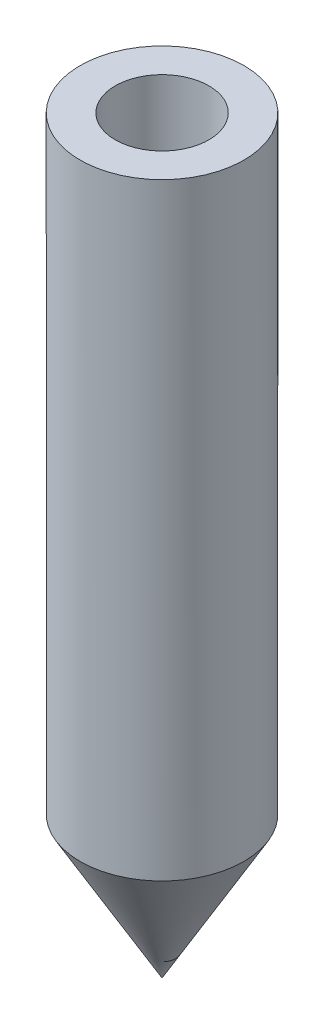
ISO-10303-21;
HEADER;
FILE_DESCRIPTION(('STEP AP214'),'2;1');
FILE_NAME('part.step','',(''),(''),'','','');
FILE_SCHEMA(('AUTOMOTIVE_DESIGN { 1 0 10303 214 1 1 1 1 }'));
ENDSEC;
DATA;
#1=APPLICATION_CONTEXT('core data for automotive mechanical design processes');
#2=APPLICATION_PROTOCOL_DEFINITION('international standard','automotive_design',2000,#1);
#3=PRODUCT_CONTEXT('',#1,'mechanical');
#4=PRODUCT('Part','Part','',(#3));
#5=PRODUCT_RELATED_PRODUCT_CATEGORY('part','',(#4));
#6=PRODUCT_DEFINITION_FORMATION('','',#4);
#7=PRODUCT_DEFINITION_CONTEXT('part definition',#1,'design');
#8=PRODUCT_DEFINITION('design','',#6,#7);
#9=PRODUCT_DEFINITION_SHAPE('','',#8);
#10=(LENGTH_UNIT() NAMED_UNIT(*) SI_UNIT(.MILLI.,.METRE.));
#11=(NAMED_UNIT(*) PLANE_ANGLE_UNIT() SI_UNIT($,.RADIAN.));
#12=(NAMED_UNIT(*) SI_UNIT($,.STERADIAN.) SOLID_ANGLE_UNIT());
#13=UNCERTAINTY_MEASURE_WITH_UNIT(LENGTH_MEASURE(1.E-05),#10,'distance_accuracy_value','');
#14=(GEOMETRIC_REPRESENTATION_CONTEXT(3) GLOBAL_UNCERTAINTY_ASSIGNED_CONTEXT((#13)) GLOBAL_UNIT_ASSIGNED_CONTEXT((#10,
#11,#12)) REPRESENTATION_CONTEXT('',''));
#15=CARTESIAN_POINT('',(0.,0.,0.));
#16=DIRECTION('',(0.,0.,1.));
#17=DIRECTION('',(1.,0.,0.));
#18=AXIS2_PLACEMENT_3D('',#15,#16,#17);
#19=CARTESIAN_POINT('',(0.,19.05,0.));
#20=DIRECTION('',(0.,-1.,0.));
#21=DIRECTION('',(0.,0.,-1.));
#22=AXIS2_PLACEMENT_3D('',#19,#20,#21);
#23=CYLINDRICAL_SURFACE('',#22,2.0828);
#24=CARTESIAN_POINT('',(0.,3.6075154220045,0.));
#25=DIRECTION('',(0.,1.,0.));
#26=DIRECTION('',(0.,0.,1.));
#27=AXIS2_PLACEMENT_3D('',#24,#25,#26);
#28=CIRCLE('',#27,2.0828);
#29=CARTESIAN_POINT('',(0.,3.6075154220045,-2.0828));
#30=VERTEX_POINT('',#29);
#31=EDGE_CURVE('E52',#30,#30,#28,.T.);
#32=CARTESIAN_POINT('',(0.,19.05,0.));
#33=DIRECTION('',(0.,1.,0.));
#34=DIRECTION('',(0.,0.,1.));
#35=AXIS2_PLACEMENT_3D('',#32,#33,#34);
#36=CIRCLE('',#35,2.0828);
#37=CARTESIAN_POINT('',(0.,19.05,-2.0828));
#38=VERTEX_POINT('',#37);
#39=EDGE_CURVE('E87',#38,#38,#36,.T.);
#40=CARTESIAN_POINT('',(0.,3.6075154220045,-2.0828));
#41=CARTESIAN_POINT('',(0.,3.76837463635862,-2.0828));
#42=CARTESIAN_POINT('',(0.,3.92923385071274,-2.0828));
#43=CARTESIAN_POINT('',(0.,4.25095227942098,-2.0828));
#44=CARTESIAN_POINT('',(0.,4.4118114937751,-2.0828));
#45=CARTESIAN_POINT('',(0.,4.73352992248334,-2.0828));
#46=CARTESIAN_POINT('',(0.,4.89438913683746,-2.0828));
#47=CARTESIAN_POINT('',(0.,5.2161075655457,-2.0828));
#48=CARTESIAN_POINT('',(0.,5.37696677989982,-2.0828));
#49=CARTESIAN_POINT('',(0.,5.69868520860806,-2.0828));
#50=CARTESIAN_POINT('',(0.,5.85954442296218,-2.0828));
#51=CARTESIAN_POINT('',(0.,6.18126285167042,-2.0828));
#52=CARTESIAN_POINT('',(0.,6.34212206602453,-2.0828));
#53=CARTESIAN_POINT('',(0.,6.66384049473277,-2.0828));
#54=CARTESIAN_POINT('',(0.,6.82469970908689,-2.0828));
#55=CARTESIAN_POINT('',(0.,7.14641813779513,-2.0828));
#56=CARTESIAN_POINT('',(0.,7.30727735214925,-2.0828));
#57=CARTESIAN_POINT('',(0.,7.62899578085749,-2.0828));
#58=CARTESIAN_POINT('',(0.,7.78985499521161,-2.0828));
#59=CARTESIAN_POINT('',(0.,8.11157342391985,-2.0828));
#60=CARTESIAN_POINT('',(0.,8.27243263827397,-2.0828));
#61=CARTESIAN_POINT('',(0.,8.59415106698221,-2.0828));
#62=CARTESIAN_POINT('',(0.,8.75501028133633,-2.0828));
#63=CARTESIAN_POINT('',(0.,9.07672871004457,-2.0828));
#64=CARTESIAN_POINT('',(0.,9.23758792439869,-2.0828));
#65=CARTESIAN_POINT('',(0.,9.55930635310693,-2.0828));
#66=CARTESIAN_POINT('',(0.,9.72016556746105,-2.0828));
#67=CARTESIAN_POINT('',(0.,10.0418839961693,-2.0828));
#68=CARTESIAN_POINT('',(0.,10.2027432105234,-2.0828));
#69=CARTESIAN_POINT('',(0.,10.5244616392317,-2.0828));
#70=CARTESIAN_POINT('',(0.,10.6853208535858,-2.0828));
#71=CARTESIAN_POINT('',(0.,11.007039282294,-2.0828));
#72=CARTESIAN_POINT('',(0.,11.1678984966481,-2.0828));
#73=CARTESIAN_POINT('',(0.,11.4896169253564,-2.0828));
#74=CARTESIAN_POINT('',(0.,11.6504761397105,-2.0828));
#75=CARTESIAN_POINT('',(0.,11.9721945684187,-2.0828));
#76=CARTESIAN_POINT('',(0.,12.1330537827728,-2.0828));
#77=CARTESIAN_POINT('',(0.,12.4547722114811,-2.0828));
#78=CARTESIAN_POINT('',(0.,12.6156314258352,-2.0828));
#79=CARTESIAN_POINT('',(0.,12.9373498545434,-2.0828));
#80=CARTESIAN_POINT('',(0.,13.0982090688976,-2.0828));
#81=CARTESIAN_POINT('',(0.,13.4199274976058,-2.0828));
#82=CARTESIAN_POINT('',(0.,13.5807867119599,-2.0828));
#83=CARTESIAN_POINT('',(0.,13.9025051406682,-2.0828));
#84=CARTESIAN_POINT('',(0.,14.0633643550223,-2.0828));
#85=CARTESIAN_POINT('',(0.,14.3850827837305,-2.0828));
#86=CARTESIAN_POINT('',(0.,14.5459419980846,-2.0828));
#87=CARTESIAN_POINT('',(0.,14.8676604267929,-2.0828));
#88=CARTESIAN_POINT('',(0.,15.028519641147,-2.0828));
#89=CARTESIAN_POINT('',(0.,15.3502380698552,-2.0828));
#90=CARTESIAN_POINT('',(0.,15.5110972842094,-2.0828));
#91=CARTESIAN_POINT('',(0.,15.8328157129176,-2.0828));
#92=CARTESIAN_POINT('',(0.,15.9936749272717,-2.0828));
#93=CARTESIAN_POINT('',(0.,16.31539335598,-2.0828));
#94=CARTESIAN_POINT('',(0.,16.4762525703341,-2.0828));
#95=CARTESIAN_POINT('',(0.,16.7979709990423,-2.0828));
#96=CARTESIAN_POINT('',(0.,16.9588302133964,-2.0828));
#97=CARTESIAN_POINT('',(0.,17.2805486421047,-2.0828));
#98=CARTESIAN_POINT('',(0.,17.4414078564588,-2.0828));
#99=CARTESIAN_POINT('',(0.,17.763126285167,-2.0828));
#100=CARTESIAN_POINT('',(0.,17.9239854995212,-2.0828));
#101=CARTESIAN_POINT('',(0.,18.2457039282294,-2.0828));
#102=CARTESIAN_POINT('',(0.,18.4065631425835,-2.0828));
#103=CARTESIAN_POINT('',(0.,18.7282815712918,-2.0828));
#104=CARTESIAN_POINT('',(0.,18.8891407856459,-2.0828));
#105=CARTESIAN_POINT('',(0.,19.05,-2.0828));
#106=B_SPLINE_CURVE_WITH_KNOTS('',3,(#40,#41,#42,#43,#44,#45,#46,#47,#48,#49,#50,#51,#52,#53,
#54,#55,#56,#57,#58,#59,#60,#61,#62,#63,#64,#65,#66,#67,#68,#69,#70,#71,#72,#73,#74,#75,#76,#77,
#78,#79,#80,#81,#82,#83,#84,#85,#86,#87,#88,#89,#90,#91,#92,#93,#94,#95,#96,#97,#98,#99,#100,
#101,#102,#103,#104,#105),.UNSPECIFIED.,.F.,.F.,(4,2,2,2,2,2,2,2,2,2,2,2,2,2,2,2,2,2,2,2,2,2,2,
2,2,2,2,2,2,2,2,2,4),(0.,0.48257764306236,0.965155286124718,1.44773292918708,1.93031057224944,
2.4128882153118,2.89546585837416,3.37804350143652,3.86062114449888,4.34319878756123,
4.82577643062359,5.30835407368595,5.79093171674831,6.27350935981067,6.75608700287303,
7.23866464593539,7.72124228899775,8.20381993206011,8.68639757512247,9.16897521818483,
9.65155286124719,10.1341305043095,10.6167081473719,11.0992857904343,11.5818634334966,
12.064441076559,12.5470187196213,13.0295963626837,13.5121740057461,13.9947516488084,
14.4773292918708,14.9599069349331,15.4424845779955),.UNSPECIFIED.);
#107=EDGE_CURVE('BSEAM41',#30,#38,#106,.T.);
#108=ORIENTED_EDGE('',*,*,#31,.T.);
#109=ORIENTED_EDGE('',*,*,#39,.F.);
#110=ORIENTED_EDGE('',*,*,#107,.T.);
#111=ORIENTED_EDGE('',*,*,#107,.F.);
#112=EDGE_LOOP('',(#108,#110,#109,#111));
#113=FACE_BOUND('',#112,.T.);
#114=ADVANCED_FACE('F41',(#113),#23,.T.);
#115=CARTESIAN_POINT('',(0.,19.05,0.));
#116=DIRECTION('',(0.,1.,0.));
#117=DIRECTION('',(0.,0.,1.));
#118=AXIS2_PLACEMENT_3D('',#115,#116,#117);
#119=PLANE('',#118);
#120=CARTESIAN_POINT('',(0.,19.05,0.));
#121=DIRECTION('',(0.,1.,0.));
#122=DIRECTION('',(0.,0.,1.));
#123=AXIS2_PLACEMENT_3D('',#120,#121,#122);
#124=CIRCLE('',#123,1.190625);
#125=CARTESIAN_POINT('',(0.,19.05,1.190625));
#126=VERTEX_POINT('',#125);
#127=EDGE_CURVE('E90',#126,#126,#124,.T.);
#128=ORIENTED_EDGE('',*,*,#127,.F.);
#129=EDGE_LOOP('',(#128));
#130=FACE_BOUND('',#129,.T.);
#131=ORIENTED_EDGE('',*,*,#39,.T.);
#132=EDGE_LOOP('',(#131));
#133=FACE_BOUND('',#132,.T.);
#134=ADVANCED_FACE('F68',(#130,#133),#119,.T.);
#135=CARTESIAN_POINT('',(0.,3.6075154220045,0.));
#136=DIRECTION('',(0.,1.,0.));
#137=DIRECTION('',(0.,0.,1.));
#138=AXIS2_PLACEMENT_3D('',#135,#136,#137);
#139=CONICAL_SURFACE('',#138,2.08280000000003,0.5235987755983);
#140=CARTESIAN_POINT('',(0.,0.,0.));
#141=VERTEX_POINT('',#140);
#142=VERTEX_LOOP('',#141);
#143=FACE_BOUND('',#142,.T.);
#144=ORIENTED_EDGE('',*,*,#31,.F.);
#145=EDGE_LOOP('',(#144));
#146=FACE_BOUND('',#145,.T.);
#147=ADVANCED_FACE('F63',(#143,#146),#139,.T.);
#148=CARTESIAN_POINT('',(0.,15.875,0.));
#149=DIRECTION('',(0.,1.,0.));
#150=DIRECTION('',(0.,0.,1.));
#151=AXIS2_PLACEMENT_3D('',#148,#149,#150);
#152=CYLINDRICAL_SURFACE('',#151,1.190625);
#153=CARTESIAN_POINT('',(0.,17.065625,0.));
#154=DIRECTION('',(0.,1.,0.));
#155=DIRECTION('',(0.,0.,1.));
#156=AXIS2_PLACEMENT_3D('',#153,#154,#155);
#157=CIRCLE('',#156,1.190625);
#158=CARTESIAN_POINT('',(0.,17.065625,1.190625));
#159=VERTEX_POINT('',#158);
#160=EDGE_CURVE('E11',#159,#159,#157,.F.);
#161=ORIENTED_EDGE('',*,*,#160,.T.);
#162=EDGE_LOOP('',(#161));
#163=FACE_BOUND('',#162,.T.);
#164=ORIENTED_EDGE('',*,*,#127,.T.);
#165=EDGE_LOOP('',(#164));
#166=FACE_BOUND('',#165,.T.);
#167=ADVANCED_FACE('F58',(#163,#166),#152,.F.);
#168=CARTESIAN_POINT('',(0.,17.065625,0.));
#169=DIRECTION('',(0.,1.,0.));
#170=DIRECTION('',(0.,0.,1.));
#171=AXIS2_PLACEMENT_3D('',#168,#169,#170);
#172=CONICAL_SURFACE('',#171,1.19062500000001,0.785398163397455);
#173=ORIENTED_EDGE('',*,*,#160,.F.);
#174=EDGE_LOOP('',(#173));
#175=FACE_BOUND('',#174,.T.);
#176=CARTESIAN_POINT('',(0.,15.875,0.));
#177=VERTEX_POINT('',#176);
#178=VERTEX_LOOP('',#177);
#179=FACE_BOUND('',#178,.T.);
#180=ADVANCED_FACE('F44',(#175,#179),#172,.F.);
#181=CLOSED_SHELL('',(#114,#134,#147,#167,#180));
#182=MANIFOLD_SOLID_BREP('B2',#181);
#183=ADVANCED_BREP_SHAPE_REPRESENTATION('',(#18,#182),#14);
#184=SHAPE_DEFINITION_REPRESENTATION(#9,#183);
ENDSEC;
END-ISO-10303-21;
